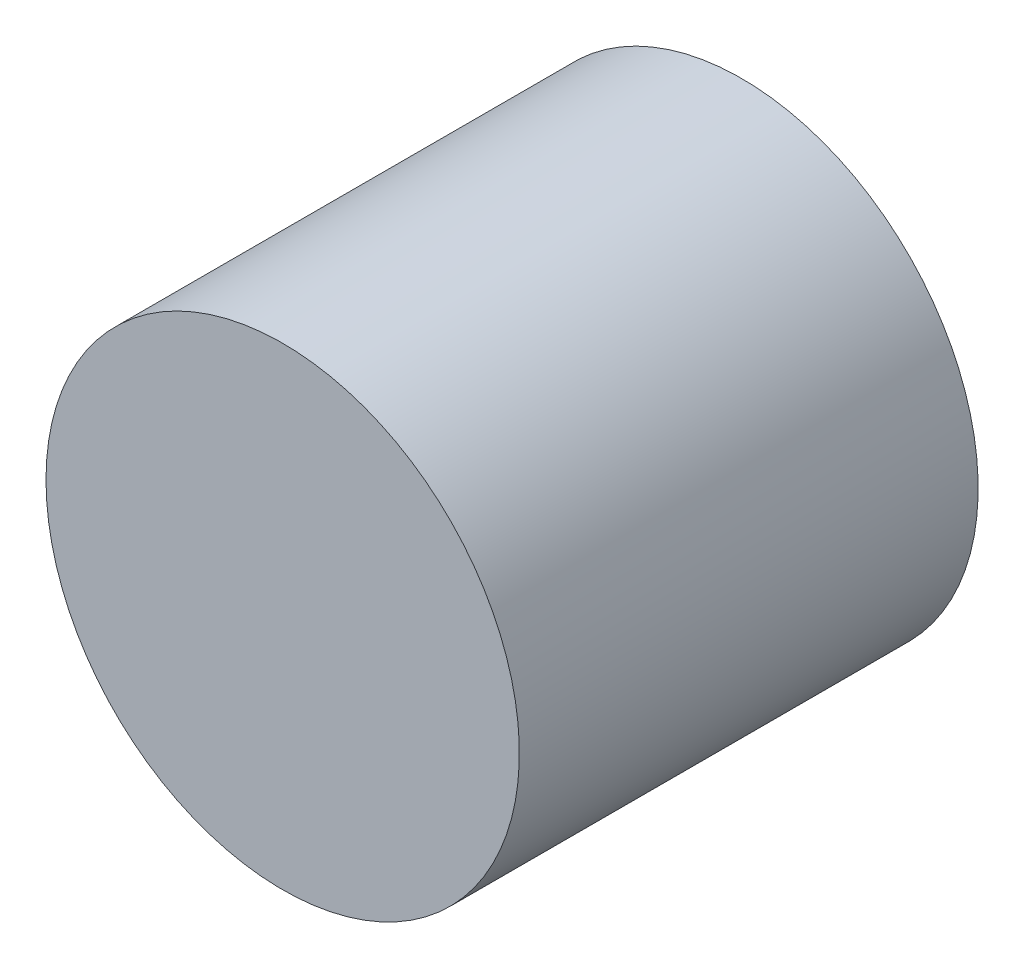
ISO-10303-21;
HEADER;
FILE_DESCRIPTION(('STEP AP214'),'2;1');
FILE_NAME('part.step','',(''),(''),'','','');
FILE_SCHEMA(('AUTOMOTIVE_DESIGN { 1 0 10303 214 1 1 1 1 }'));
ENDSEC;
DATA;
#1=APPLICATION_CONTEXT('core data for automotive mechanical design processes');
#2=APPLICATION_PROTOCOL_DEFINITION('international standard','automotive_design',2000,#1);
#3=PRODUCT_CONTEXT('',#1,'mechanical');
#4=PRODUCT('Part','Part','',(#3));
#5=PRODUCT_RELATED_PRODUCT_CATEGORY('part','',(#4));
#6=PRODUCT_DEFINITION_FORMATION('','',#4);
#7=PRODUCT_DEFINITION_CONTEXT('part definition',#1,'design');
#8=PRODUCT_DEFINITION('design','',#6,#7);
#9=PRODUCT_DEFINITION_SHAPE('','',#8);
#10=(LENGTH_UNIT() NAMED_UNIT(*) SI_UNIT(.MILLI.,.METRE.));
#11=(NAMED_UNIT(*) PLANE_ANGLE_UNIT() SI_UNIT($,.RADIAN.));
#12=(NAMED_UNIT(*) SI_UNIT($,.STERADIAN.) SOLID_ANGLE_UNIT());
#13=UNCERTAINTY_MEASURE_WITH_UNIT(LENGTH_MEASURE(1.E-05),#10,'distance_accuracy_value','');
#14=(GEOMETRIC_REPRESENTATION_CONTEXT(3) GLOBAL_UNCERTAINTY_ASSIGNED_CONTEXT((#13)) GLOBAL_UNIT_ASSIGNED_CONTEXT((#10,
#11,#12)) REPRESENTATION_CONTEXT('',''));
#15=CARTESIAN_POINT('',(0.,0.,0.));
#16=DIRECTION('',(0.,0.,1.));
#17=DIRECTION('',(1.,0.,0.));
#18=AXIS2_PLACEMENT_3D('',#15,#16,#17);
#19=CARTESIAN_POINT('',(0.,0.,8.001));
#20=DIRECTION('',(0.,0.,1.));
#21=DIRECTION('',(1.,0.,0.));
#22=AXIS2_PLACEMENT_3D('',#19,#20,#21);
#23=PLANE('',#22);
#24=CARTESIAN_POINT('',(0.,0.,8.001));
#25=DIRECTION('',(0.,0.,-1.));
#26=DIRECTION('',(-1.,0.,0.));
#27=AXIS2_PLACEMENT_3D('',#24,#25,#26);
#28=CIRCLE('',#27,4.1275);
#29=CARTESIAN_POINT('',(-4.1275,0.,8.001));
#30=VERTEX_POINT('',#29);
#31=EDGE_CURVE('E18',#30,#30,#28,.T.);
#32=ORIENTED_EDGE('',*,*,#31,.F.);
#33=EDGE_LOOP('',(#32));
#34=FACE_BOUND('',#33,.T.);
#35=ADVANCED_FACE('F15',(#34),#23,.T.);
#36=CARTESIAN_POINT('',(0.,0.,0.));
#37=DIRECTION('',(0.,0.,1.));
#38=DIRECTION('',(1.,0.,0.));
#39=AXIS2_PLACEMENT_3D('',#36,#37,#38);
#40=PLANE('',#39);
#41=CARTESIAN_POINT('',(0.,0.,0.));
#42=DIRECTION('',(0.,0.,-1.));
#43=DIRECTION('',(-1.,0.,0.));
#44=AXIS2_PLACEMENT_3D('',#41,#42,#43);
#45=CIRCLE('',#44,4.1275);
#46=CARTESIAN_POINT('',(-4.1275,0.,0.));
#47=VERTEX_POINT('',#46);
#48=EDGE_CURVE('E10',#47,#47,#45,.F.);
#49=ORIENTED_EDGE('',*,*,#48,.F.);
#50=EDGE_LOOP('',(#49));
#51=FACE_BOUND('',#50,.T.);
#52=ADVANCED_FACE('F30',(#51),#40,.F.);
#53=CARTESIAN_POINT('',(0.,0.,8.001));
#54=DIRECTION('',(0.,0.,-1.));
#55=DIRECTION('',(-1.,0.,0.));
#56=AXIS2_PLACEMENT_3D('',#53,#54,#55);
#57=CYLINDRICAL_SURFACE('',#56,4.1275);
#58=ORIENTED_EDGE('',*,*,#48,.T.);
#59=EDGE_LOOP('',(#58));
#60=FACE_BOUND('',#59,.T.);
#61=ORIENTED_EDGE('',*,*,#31,.T.);
#62=EDGE_LOOP('',(#61));
#63=FACE_BOUND('',#62,.T.);
#64=ADVANCED_FACE('F27',(#60,#63),#57,.T.);
#65=CLOSED_SHELL('',(#35,#52,#64));
#66=MANIFOLD_SOLID_BREP('B1',#65);
#67=ADVANCED_BREP_SHAPE_REPRESENTATION('',(#18,#66),#14);
#68=SHAPE_DEFINITION_REPRESENTATION(#9,#67);
ENDSEC;
END-ISO-10303-21;
